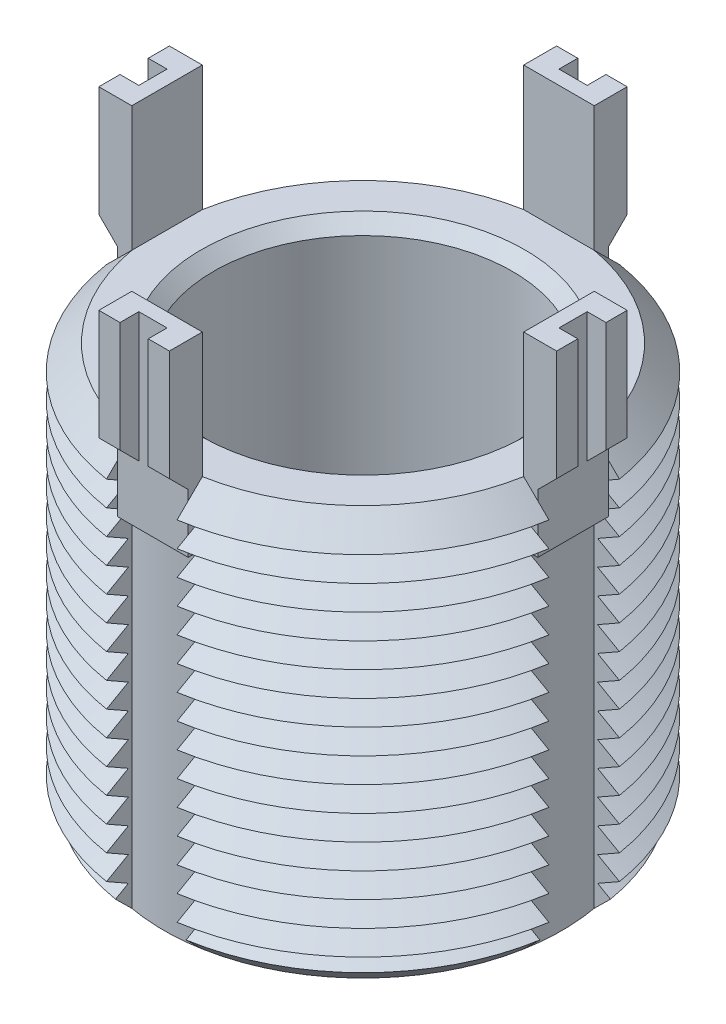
from build123d import *

# Parameters (mm, degrees)
SKETCH1_R               = 19.05
BOSS_EXTRUDE1_DEPTH     = 34.798
CHAMFER1_SIZE           = 2.117
LPATTERN1_COUNT         = 15
LPATTERN1_PITCH         = 2.117
CUT_EXTRUDE1_REACH      = 46.008
CIRPATTERN1_COUNT       = 4
BOSS_EXTRUDE3_DEPTH     = 3
CIRPATTERN2_COUNT       = 4
CUT_EXTRUDE3_DEPTH      = 54.133908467
CUT_EXTRUDE3_DEPTH_BACK = 54.133908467
SKETCH6_W               = 1.6
SKETCH6_H               = 2.4
SKETCH6_W_2             = 2.4
SKETCH6_H_2             = 1.6
SKETCH7_R               = 12.7
CUT_EXTRUDE4_DEPTH      = 34.798
CHAMFER2_SIZE           = 1.0585


with BuildPart() as part:
    # Sketch1 → Boss-Extrude1 (new body)
    with BuildSketch(Plane(origin=(0, 0, 0), x_dir=(1, 0, 0), z_dir=(0, 1, 0))):
        with Locations(Location((0, 0, 0), (0, 0, 270))):
            Circle(SKETCH1_R)
    extrude(amount=-BOSS_EXTRUDE1_DEPTH)

    # Chamfer1
    chamfer1_edges = [part.edges().sort_by_distance(p)[0] for p in [
        (0, 0, -19.05),
        (0, -34.798, -19.05),
    ]]
    chamfer(chamfer1_edges, length=CHAMFER1_SIZE)

    # Sketch3 → Cut-Revolve1 (revolve, cut)
    with BuildSketch(Plane(origin=(0, 0, 0), x_dir=(0, 0, -1), z_dir=(1, 0, 0))):
        Polygon((-19.05, -2.117), (-17.21662422, -3.1755), (-19.05, -4.234), align=None)
    cut_revolve1 = revolve(axis=Axis((0, 0.885892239, 0), (0, -1, 0)), mode=Mode.SUBTRACT)

    # LPattern1: Cut-Revolve1 ×15
    with Locations(*[(0, -i * LPATTERN1_PITCH, 0) for i in range(1, LPATTERN1_COUNT)]):
        add(cut_revolve1, mode=Mode.SUBTRACT)

    # Cut-Extrude1: up to this cone (the profile starts inside it)
    cut_extrude1_end = Plane(origin=(0, 0, 0), z_dir=(0, 1, 0)).offset(-51.730999) * Cone(1e-06, 149.97, 149.969999, align=(Align.CENTER, Align.CENTER, Align.MIN), mode=Mode.PRIVATE)
    # Sketch4 → Cut-Extrude1 (cut, up to the surface)
    with BuildSketch(Plane(origin=(0, 0, 0), x_dir=(1, 0, 0), z_dir=(0, 1, 0)), mode=Mode.PRIVATE) as cut_extrude1_sk1:
        with BuildLine():
            Line((-16.665127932, 3), (-18.812296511, 3))
            ThreePointArc((-18.812296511, 3), (-19.05, 0), (-18.812296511, -3))
            Line((-18.812296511, -3), (-16.665127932, -3))
            ThreePointArc((-16.665127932, -3), (-16.933, 0), (-16.665127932, 3))
        make_face()
    cut_extrude1_tool1 = extrude(cut_extrude1_sk1.sketch, amount=-CUT_EXTRUDE1_REACH, mode=Mode.PRIVATE) & cut_extrude1_end
    cut_extrude1 = cut_extrude1_tool1.solids().sort_by_distance((-17.907162, 0, 0))[0]
    add(cut_extrude1, mode=Mode.SUBTRACT)

    # CirPattern1: Cut-Extrude1 ×4 about axis
    cirpattern1_axis = Axis((0, 0, 0), (0, 1, 0))
    for i in range(1, CIRPATTERN1_COUNT):
        add(cut_extrude1.rotate(cirpattern1_axis, i * 360 / CIRPATTERN1_COUNT), mode=Mode.SUBTRACT)

    # Sketch5 → Boss-Extrude3 (add, symmetric)
    with BuildSketch(Plane(origin=(0, 0, 0), x_dir=(0, 0, -1), z_dir=(1, 0, 0))):
        Polygon((-16.665127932, 10.649), (-16.665127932, -5.351), (-17.865127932, -5.351), (-17.865127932, -0.351), (-19.465127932, 1.249), (-19.465127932, 10.649), align=None)
    boss_extrude3 = extrude(amount=BOSS_EXTRUDE3_DEPTH, both=True)

    # CirPattern2: Boss-Extrude3 ×4 about axis
    cirpattern2_axis = Axis((0, 0, 0), (0, 1, 0))
    for i in range(1, CIRPATTERN2_COUNT):
        add(boss_extrude3.rotate(cirpattern2_axis, i * 360 / CIRPATTERN2_COUNT))

    # Sketch6 → Cut-Extrude3 (cut, two sides: drawn at the far end of the back side and taken through both)
    with BuildSketch(Plane(origin=(0, 10.649, 0), x_dir=(1, 0, 0), z_dir=(0, 1, 0)).offset(-CUT_EXTRUDE3_DEPTH_BACK)):
        with Locations((-18.665127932, 0)):
            Rectangle(SKETCH6_W, SKETCH6_H)
        with Locations((0, 18.665127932)):
            Rectangle(SKETCH6_W_2, SKETCH6_H_2)
        with Locations((18.665127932, 0)):
            Rectangle(SKETCH6_W, SKETCH6_H)
        with Locations((0, -18.665127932)):
            Rectangle(SKETCH6_W_2, SKETCH6_H_2)
    extrude(amount=CUT_EXTRUDE3_DEPTH + CUT_EXTRUDE3_DEPTH_BACK, mode=Mode.SUBTRACT)

    # Sketch7 → Cut-Extrude4 (cut)
    with BuildSketch(Plane(origin=(0, 0, 0), x_dir=(1, 0, 0), z_dir=(0, 1, 0))):
        with Locations(Location((0, 0, 0), (0, 0, 270))):
            Circle(SKETCH7_R)
    extrude(amount=-CUT_EXTRUDE4_DEPTH, mode=Mode.SUBTRACT)

    # Chamfer2
    chamfer2_edges = [part.edges().sort_by_distance(p)[0] for p in [
        (0, 0, -12.7),
        (0, -34.798, -12.7),
    ]]
    chamfer(chamfer2_edges, length=CHAMFER2_SIZE)


solid = part.part
